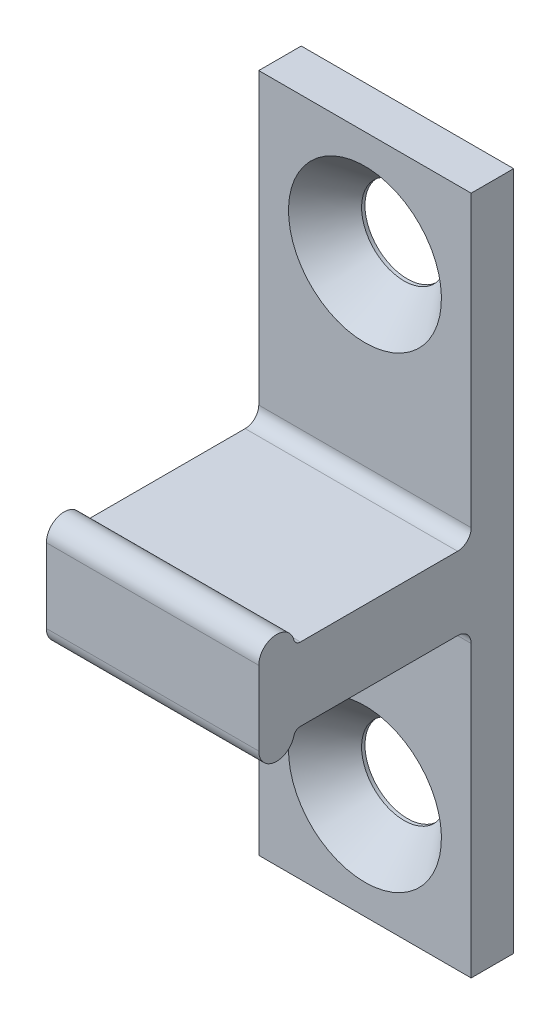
from build123d import *

# Parameters (mm, degrees)
BOSS_EXTRUDE1_DEPTH                           = 3.96875
CSK_FOR_4_FLAT_HEAD_MACHINE_SCREW1_AT_2_COUNT = 2
CSK_FOR_4_FLAT_HEAD_MACHINE_SCREW1_AT_2_PITCH = 17.4625


with BuildPart() as part:
    # Sketch2 → Boss-Extrude1 (new, symmetric)
    with BuildSketch(Plane(origin=(0, 0, 0), x_dir=(0, 0, -1), z_dir=(1, 0, 0))):
        with BuildLine():
            Line((0, -12.7), (0, 12.7))
            Line((0, 12.7), (-1.5875, 12.7))
            Line((-1.5875, 12.7), (-1.5875, 1.87325))
            ThreePointArc((-1.5875, 1.87325), (-1.736289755, 1.514039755), (-2.0955, 1.36525))
            Line((-2.0955, 1.36525), (-7.966973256, 1.36525))
            ThreePointArc((-7.966973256, 1.36525), (-8.122354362, 1.418320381), (-8.212805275, 1.55535463))
            ThreePointArc((-8.212805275, 1.55535463), (-8.942734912, 2.049048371), (-9.525, 1.387611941))
            Line((-9.525, 1.387611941), (-9.525, -1.387611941))
            ThreePointArc((-9.525, -1.387611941), (-8.942734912, -2.049048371), (-8.212805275, -1.55535463))
            ThreePointArc((-8.212805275, -1.55535463), (-8.122354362, -1.418320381), (-7.966973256, -1.36525))
            Line((-7.966973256, -1.36525), (-2.0955, -1.36525))
            ThreePointArc((-2.0955, -1.36525), (-1.736289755, -1.514039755), (-1.5875, -1.87325))
            Line((-1.5875, -1.87325), (-1.5875, -12.7))
            Line((-1.5875, -12.7), (0, -12.7))
        make_face()
    extrude(amount=BOSS_EXTRUDE1_DEPTH, both=True)

    # Sketch3 → CSK for _4 Flat Head Machine Screw1 (revolve, cut)
    with BuildSketch(Plane(origin=(0, 8.73125, 1.5875), x_dir=(0, -1, 0), z_dir=(1, 0, 0))):
        Polygon((0, 0), (0, 1.5875), (1.5875, 1.5875), (1.5875, 1.460967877), (2.8575, 0), align=None)
    csk_for_4_flat_head_machine_screw1 = revolve(axis=Axis((0, 8.73125, 7.9375), (0, 0, -1)), mode=Mode.SUBTRACT)

    # CSK for _4 Flat Head Machine Screw1 at 2: CSK for _4 Flat Head Machine Screw1 ×2
    with Locations(*[(0, -i * CSK_FOR_4_FLAT_HEAD_MACHINE_SCREW1_AT_2_PITCH, 0) for i in range(1, CSK_FOR_4_FLAT_HEAD_MACHINE_SCREW1_AT_2_COUNT)]):
        add(csk_for_4_flat_head_machine_screw1, mode=Mode.SUBTRACT)


solid = part.part
